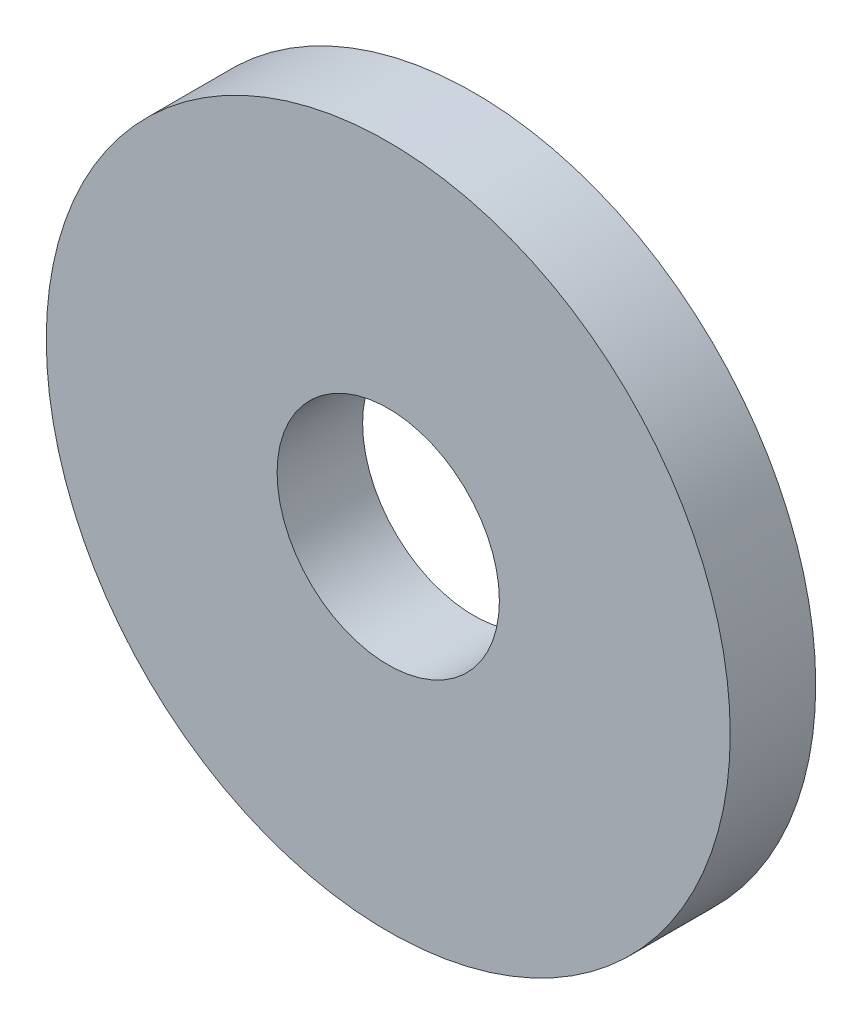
from build123d import *

# Parameters (mm, degrees)
ESQUISSE1_R          = 20
ESQUISSE1_R_2        = 6.5
BASE_EXTRUSION_DEPTH = 5


with BuildPart() as part:
    # Esquisse1 → Base-Extrusion (new body)
    with BuildSketch(Plane.XY):
        Circle(ESQUISSE1_R)
        Circle(ESQUISSE1_R_2, mode=Mode.SUBTRACT)
    extrude(amount=BASE_EXTRUSION_DEPTH)


solid = part.part
